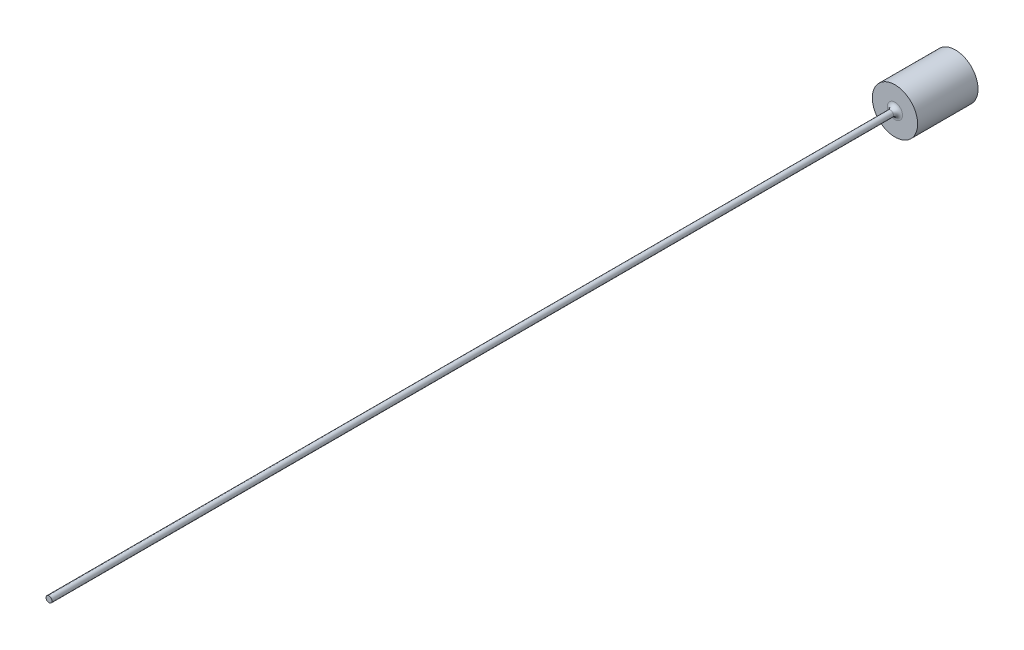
from build123d import *

# Parameters (mm, degrees)
FILLET1_R = 0.3


with BuildPart() as part:
    # FV → Revolve1 (revolve)
    with BuildSketch(Plane(origin=(0, 0, 0), x_dir=(1, 0, 0), z_dir=(0, 1, 0)), mode=Mode.PRIVATE) as revolve1_sk:
        Polygon((0, 0), (1.5, 0), (1.5, -4), (0.2, -4), (0.2, -60), (0, -60), align=None)
    revolve(revolve1_sk.sketch.rotate(Axis((0, 0, -9.033228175), (0, 0, 1)), 180), axis=Axis((0, 0, -9.033228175), (0, 0, 1)))

    # Fillet1
    fillet1_edges = [part.edges().sort_by_distance(p)[0] for p in [
        (0.2, 0, 4),
    ]]
    fillet(fillet1_edges, radius=FILLET1_R)


solid = part.part
